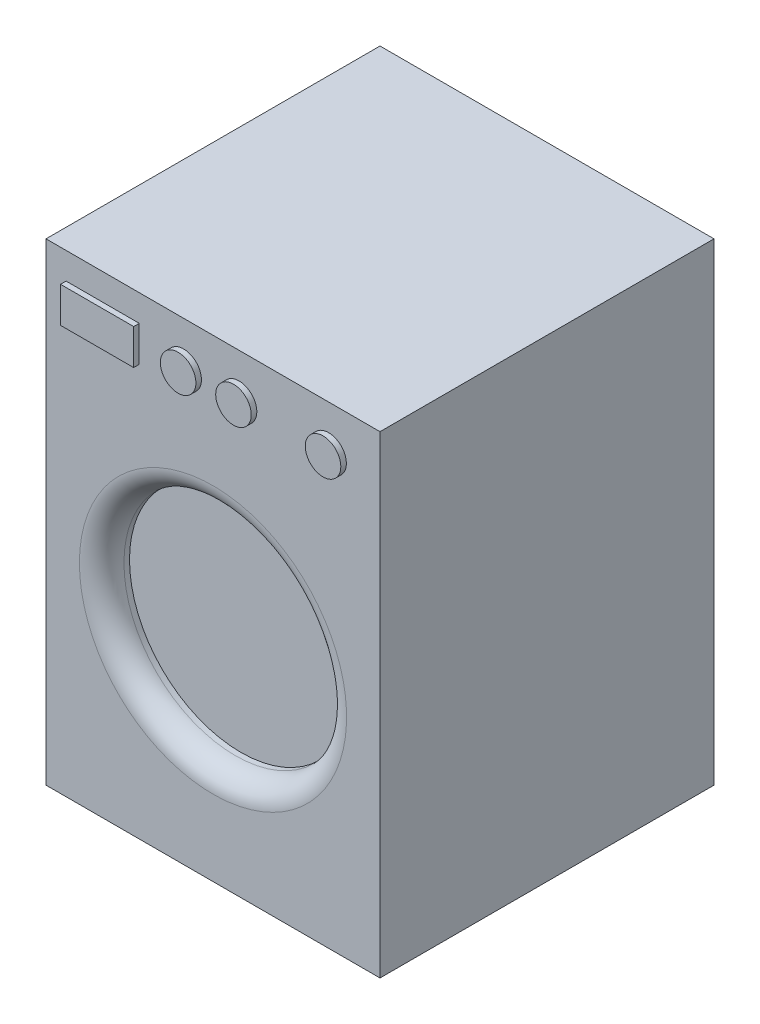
ISO-10303-21;
HEADER;
FILE_DESCRIPTION(('STEP AP214'),'2;1');
FILE_NAME('part.step','',(''),(''),'','','');
FILE_SCHEMA(('AUTOMOTIVE_DESIGN { 1 0 10303 214 1 1 1 1 }'));
ENDSEC;
DATA;
#1=APPLICATION_CONTEXT('core data for automotive mechanical design processes');
#2=APPLICATION_PROTOCOL_DEFINITION('international standard','automotive_design',2000,#1);
#3=PRODUCT_CONTEXT('',#1,'mechanical');
#4=PRODUCT('Part','Part','',(#3));
#5=PRODUCT_RELATED_PRODUCT_CATEGORY('part','',(#4));
#6=PRODUCT_DEFINITION_FORMATION('','',#4);
#7=PRODUCT_DEFINITION_CONTEXT('part definition',#1,'design');
#8=PRODUCT_DEFINITION('design','',#6,#7);
#9=PRODUCT_DEFINITION_SHAPE('','',#8);
#10=(LENGTH_UNIT() NAMED_UNIT(*) SI_UNIT(.MILLI.,.METRE.));
#11=(NAMED_UNIT(*) PLANE_ANGLE_UNIT() SI_UNIT($,.RADIAN.));
#12=(NAMED_UNIT(*) SI_UNIT($,.STERADIAN.) SOLID_ANGLE_UNIT());
#13=UNCERTAINTY_MEASURE_WITH_UNIT(LENGTH_MEASURE(1.E-05),#10,'distance_accuracy_value','');
#14=(GEOMETRIC_REPRESENTATION_CONTEXT(3) GLOBAL_UNCERTAINTY_ASSIGNED_CONTEXT((#13)) GLOBAL_UNIT_ASSIGNED_CONTEXT((#10,
#11,#12)) REPRESENTATION_CONTEXT('',''));
#15=CARTESIAN_POINT('',(0.,0.,0.));
#16=DIRECTION('',(0.,0.,1.));
#17=DIRECTION('',(1.,0.,0.));
#18=AXIS2_PLACEMENT_3D('',#15,#16,#17);
#19=CARTESIAN_POINT('',(300.,850.,300.));
#20=DIRECTION('',(0.,0.,-1.));
#21=DIRECTION('',(-1.,0.,0.));
#22=AXIS2_PLACEMENT_3D('',#19,#20,#21);
#23=PLANE('',#22);
#24=CARTESIAN_POINT('',(207.647023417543,770.356504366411,300.));
#25=DIRECTION('',(0.,0.,-1.));
#26=DIRECTION('',(-1.,0.,0.));
#27=AXIS2_PLACEMENT_3D('',#24,#25,#26);
#28=CIRCLE('',#27,31.9295040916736);
#29=CARTESIAN_POINT('',(175.71751932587,770.356504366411,300.));
#30=VERTEX_POINT('',#29);
#31=EDGE_CURVE('E11',#30,#30,#28,.F.);
#32=ORIENTED_EDGE('',*,*,#31,.F.);
#33=EDGE_LOOP('',(#32));
#34=FACE_BOUND('',#33,.T.);
#35=CARTESIAN_POINT('',(46.7714451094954,770.356504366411,300.));
#36=DIRECTION('',(0.,0.,-1.));
#37=DIRECTION('',(-1.,0.,0.));
#38=AXIS2_PLACEMENT_3D('',#35,#36,#37);
#39=CIRCLE('',#38,31.9295040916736);
#40=CARTESIAN_POINT('',(14.8419410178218,770.356504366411,300.));
#41=VERTEX_POINT('',#40);
#42=EDGE_CURVE('E42',#41,#41,#39,.F.);
#43=ORIENTED_EDGE('',*,*,#42,.F.);
#44=EDGE_LOOP('',(#43));
#45=FACE_BOUND('',#44,.T.);
#46=CARTESIAN_POINT('',(-52.7012407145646,770.356504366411,300.));
#47=DIRECTION('',(0.,0.,-1.));
#48=DIRECTION('',(-1.,0.,0.));
#49=AXIS2_PLACEMENT_3D('',#46,#47,#48);
#50=CIRCLE('',#49,31.9295040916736);
#51=CARTESIAN_POINT('',(-84.6307448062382,770.356504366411,300.));
#52=VERTEX_POINT('',#51);
#53=EDGE_CURVE('E164',#52,#52,#50,.F.);
#54=ORIENTED_EDGE('',*,*,#53,.F.);
#55=EDGE_LOOP('',(#54));
#56=FACE_BOUND('',#55,.T.);
#57=DIRECTION('',(1.,0.,0.));
#58=VECTOR('',#57,1.);
#59=CARTESIAN_POINT('',(300.,0.,300.));
#60=LINE('',#59,#58);
#61=CARTESIAN_POINT('',(-300.,0.,300.));
#62=VERTEX_POINT('',#61);
#63=CARTESIAN_POINT('',(300.,0.,300.));
#64=VERTEX_POINT('',#63);
#65=EDGE_CURVE('E142',#62,#64,#60,.T.);
#66=ORIENTED_EDGE('',*,*,#65,.T.);
#67=DIRECTION('',(0.,-1.,0.));
#68=VECTOR('',#67,1.);
#69=CARTESIAN_POINT('',(300.,850.,300.));
#70=LINE('',#69,#68);
#71=CARTESIAN_POINT('',(300.,850.,300.));
#72=VERTEX_POINT('',#71);
#73=EDGE_CURVE('E152',#72,#64,#70,.T.);
#74=ORIENTED_EDGE('',*,*,#73,.F.);
#75=DIRECTION('',(1.,0.,0.));
#76=VECTOR('',#75,1.);
#77=CARTESIAN_POINT('',(300.,850.,300.));
#78=LINE('',#77,#76);
#79=CARTESIAN_POINT('',(-300.,850.,300.));
#80=VERTEX_POINT('',#79);
#81=EDGE_CURVE('E132',#80,#72,#78,.T.);
#82=ORIENTED_EDGE('',*,*,#81,.F.);
#83=DIRECTION('',(0.,-1.,0.));
#84=VECTOR('',#83,1.);
#85=CARTESIAN_POINT('',(-300.,850.,300.));
#86=LINE('',#85,#84);
#87=EDGE_CURVE('E155',#80,#62,#86,.T.);
#88=ORIENTED_EDGE('',*,*,#87,.T.);
#89=EDGE_LOOP('',(#66,#74,#82,#88));
#90=FACE_BOUND('',#89,.T.);
#91=CARTESIAN_POINT('',(0.,375.977513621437,300.));
#92=DIRECTION('',(0.,0.,-1.));
#93=DIRECTION('',(-1.,0.,0.));
#94=AXIS2_PLACEMENT_3D('',#91,#92,#93);
#95=CIRCLE('',#94,240.);
#96=CARTESIAN_POINT('',(-240.,375.977513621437,300.));
#97=VERTEX_POINT('',#96);
#98=EDGE_CURVE('E161',#97,#97,#95,.T.);
#99=ORIENTED_EDGE('',*,*,#98,.T.);
#100=EDGE_LOOP('',(#99));
#101=FACE_BOUND('',#100,.T.);
#102=DIRECTION('',(0.,-1.,0.));
#103=VECTOR('',#102,1.);
#104=CARTESIAN_POINT('',(-263.927190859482,802.286008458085,300.));
#105=LINE('',#104,#103);
#106=CARTESIAN_POINT('',(-263.927190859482,802.286008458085,300.));
#107=VERTEX_POINT('',#106);
#108=CARTESIAN_POINT('',(-263.927190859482,738.427000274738,300.));
#109=VERTEX_POINT('',#108);
#110=EDGE_CURVE('E119',#107,#109,#105,.T.);
#111=ORIENTED_EDGE('',*,*,#110,.F.);
#112=DIRECTION('',(-1.,0.,0.));
#113=VECTOR('',#112,1.);
#114=CARTESIAN_POINT('',(-263.927190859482,802.286008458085,300.));
#115=LINE('',#114,#113);
#116=CARTESIAN_POINT('',(-132.525000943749,802.286008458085,300.));
#117=VERTEX_POINT('',#116);
#118=EDGE_CURVE('E116',#117,#107,#115,.T.);
#119=ORIENTED_EDGE('',*,*,#118,.F.);
#120=DIRECTION('',(0.,1.,0.));
#121=VECTOR('',#120,1.);
#122=CARTESIAN_POINT('',(-132.525000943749,802.286008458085,300.));
#123=LINE('',#122,#121);
#124=CARTESIAN_POINT('',(-132.525000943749,738.427000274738,300.));
#125=VERTEX_POINT('',#124);
#126=EDGE_CURVE('E54',#125,#117,#123,.T.);
#127=ORIENTED_EDGE('',*,*,#126,.F.);
#128=DIRECTION('',(1.,0.,0.));
#129=VECTOR('',#128,1.);
#130=CARTESIAN_POINT('',(-263.927190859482,738.427000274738,300.));
#131=LINE('',#130,#129);
#132=EDGE_CURVE('E49',#109,#125,#131,.T.);
#133=ORIENTED_EDGE('',*,*,#132,.F.);
#134=EDGE_LOOP('',(#111,#119,#127,#133));
#135=FACE_BOUND('',#134,.T.);
#136=ADVANCED_FACE('F34',(#34,#45,#56,#90,#101,#135),#23,.F.);
#137=CARTESIAN_POINT('',(-300.,850.,300.));
#138=DIRECTION('',(1.,0.,0.));
#139=DIRECTION('',(0.,0.,-1.));
#140=AXIS2_PLACEMENT_3D('',#137,#138,#139);
#141=PLANE('',#140);
#142=DIRECTION('',(0.,0.,1.));
#143=VECTOR('',#142,1.);
#144=CARTESIAN_POINT('',(-300.,0.,300.));
#145=LINE('',#144,#143);
#146=CARTESIAN_POINT('',(-300.,0.,-300.));
#147=VERTEX_POINT('',#146);
#148=EDGE_CURVE('E123',#147,#62,#145,.T.);
#149=ORIENTED_EDGE('',*,*,#148,.T.);
#150=ORIENTED_EDGE('',*,*,#87,.F.);
#151=DIRECTION('',(0.,0.,1.));
#152=VECTOR('',#151,1.);
#153=CARTESIAN_POINT('',(-300.,850.,300.));
#154=LINE('',#153,#152);
#155=CARTESIAN_POINT('',(-300.,850.,-300.));
#156=VERTEX_POINT('',#155);
#157=EDGE_CURVE('E129',#156,#80,#154,.T.);
#158=ORIENTED_EDGE('',*,*,#157,.F.);
#159=DIRECTION('',(0.,-1.,0.));
#160=VECTOR('',#159,1.);
#161=CARTESIAN_POINT('',(-300.,850.,-300.));
#162=LINE('',#161,#160);
#163=EDGE_CURVE('E139',#156,#147,#162,.T.);
#164=ORIENTED_EDGE('',*,*,#163,.T.);
#165=EDGE_LOOP('',(#149,#150,#158,#164));
#166=FACE_BOUND('',#165,.T.);
#167=ADVANCED_FACE('F173',(#166),#141,.F.);
#168=CARTESIAN_POINT('',(300.,850.,300.));
#169=DIRECTION('',(-1.,0.,0.));
#170=DIRECTION('',(0.,0.,1.));
#171=AXIS2_PLACEMENT_3D('',#168,#169,#170);
#172=PLANE('',#171);
#173=DIRECTION('',(0.,0.,-1.));
#174=VECTOR('',#173,1.);
#175=CARTESIAN_POINT('',(300.,0.,300.));
#176=LINE('',#175,#174);
#177=CARTESIAN_POINT('',(300.,0.,-300.));
#178=VERTEX_POINT('',#177);
#179=EDGE_CURVE('E144',#64,#178,#176,.T.);
#180=ORIENTED_EDGE('',*,*,#179,.T.);
#181=DIRECTION('',(0.,-1.,0.));
#182=VECTOR('',#181,1.);
#183=CARTESIAN_POINT('',(300.,850.,-300.));
#184=LINE('',#183,#182);
#185=CARTESIAN_POINT('',(300.,850.,-300.));
#186=VERTEX_POINT('',#185);
#187=EDGE_CURVE('E149',#186,#178,#184,.T.);
#188=ORIENTED_EDGE('',*,*,#187,.F.);
#189=DIRECTION('',(0.,0.,-1.));
#190=VECTOR('',#189,1.);
#191=CARTESIAN_POINT('',(300.,850.,300.));
#192=LINE('',#191,#190);
#193=EDGE_CURVE('E135',#72,#186,#192,.T.);
#194=ORIENTED_EDGE('',*,*,#193,.F.);
#195=ORIENTED_EDGE('',*,*,#73,.T.);
#196=EDGE_LOOP('',(#180,#188,#194,#195));
#197=FACE_BOUND('',#196,.T.);
#198=ADVANCED_FACE('F263',(#197),#172,.F.);
#199=CARTESIAN_POINT('',(300.,850.,-300.));
#200=DIRECTION('',(0.,0.,1.));
#201=DIRECTION('',(1.,0.,0.));
#202=AXIS2_PLACEMENT_3D('',#199,#200,#201);
#203=PLANE('',#202);
#204=DIRECTION('',(-1.,0.,0.));
#205=VECTOR('',#204,1.);
#206=CARTESIAN_POINT('',(300.,0.,-300.));
#207=LINE('',#206,#205);
#208=EDGE_CURVE('E133',#178,#147,#207,.T.);
#209=ORIENTED_EDGE('',*,*,#208,.T.);
#210=ORIENTED_EDGE('',*,*,#163,.F.);
#211=DIRECTION('',(-1.,0.,0.));
#212=VECTOR('',#211,1.);
#213=CARTESIAN_POINT('',(300.,850.,-300.));
#214=LINE('',#213,#212);
#215=EDGE_CURVE('E137',#186,#156,#214,.T.);
#216=ORIENTED_EDGE('',*,*,#215,.F.);
#217=ORIENTED_EDGE('',*,*,#187,.T.);
#218=EDGE_LOOP('',(#209,#210,#216,#217));
#219=FACE_BOUND('',#218,.T.);
#220=ADVANCED_FACE('F256',(#219),#203,.F.);
#221=CARTESIAN_POINT('',(0.,850.,0.));
#222=DIRECTION('',(0.,1.,0.));
#223=DIRECTION('',(0.,0.,1.));
#224=AXIS2_PLACEMENT_3D('',#221,#222,#223);
#225=PLANE('',#224);
#226=ORIENTED_EDGE('',*,*,#157,.T.);
#227=ORIENTED_EDGE('',*,*,#81,.T.);
#228=ORIENTED_EDGE('',*,*,#193,.T.);
#229=ORIENTED_EDGE('',*,*,#215,.T.);
#230=EDGE_LOOP('',(#226,#227,#228,#229));
#231=FACE_BOUND('',#230,.T.);
#232=ADVANCED_FACE('F253',(#231),#225,.T.);
#233=CARTESIAN_POINT('',(0.,0.,0.));
#234=DIRECTION('',(0.,1.,0.));
#235=DIRECTION('',(0.,0.,1.));
#236=AXIS2_PLACEMENT_3D('',#233,#234,#235);
#237=PLANE('',#236);
#238=ORIENTED_EDGE('',*,*,#148,.F.);
#239=ORIENTED_EDGE('',*,*,#208,.F.);
#240=ORIENTED_EDGE('',*,*,#179,.F.);
#241=ORIENTED_EDGE('',*,*,#65,.F.);
#242=EDGE_LOOP('',(#238,#239,#240,#241));
#243=FACE_BOUND('',#242,.T.);
#244=ADVANCED_FACE('F251',(#243),#237,.F.);
#245=CARTESIAN_POINT('',(0.,375.977513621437,250.));
#246=DIRECTION('',(0.,0.,1.));
#247=DIRECTION('',(1.,0.,0.));
#248=AXIS2_PLACEMENT_3D('',#245,#246,#247);
#249=CYLINDRICAL_SURFACE('',#248,200.);
#250=CARTESIAN_POINT('',(0.,375.977513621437,260.));
#251=DIRECTION('',(0.,0.,-1.));
#252=DIRECTION('',(-1.,0.,0.));
#253=AXIS2_PLACEMENT_3D('',#250,#251,#252);
#254=CIRCLE('',#253,200.);
#255=CARTESIAN_POINT('',(-200.,375.977513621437,260.));
#256=VERTEX_POINT('',#255);
#257=EDGE_CURVE('E158',#256,#256,#254,.F.);
#258=ORIENTED_EDGE('',*,*,#257,.T.);
#259=EDGE_LOOP('',(#258));
#260=FACE_BOUND('',#259,.T.);
#261=CARTESIAN_POINT('',(0.,375.977513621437,250.));
#262=DIRECTION('',(0.,0.,1.));
#263=DIRECTION('',(1.,0.,0.));
#264=AXIS2_PLACEMENT_3D('',#261,#262,#263);
#265=CIRCLE('',#264,200.);
#266=CARTESIAN_POINT('',(200.,375.977513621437,250.));
#267=VERTEX_POINT('',#266);
#268=EDGE_CURVE('E120',#267,#267,#265,.T.);
#269=ORIENTED_EDGE('',*,*,#268,.F.);
#270=EDGE_LOOP('',(#269));
#271=FACE_BOUND('',#270,.T.);
#272=ADVANCED_FACE('F247',(#260,#271),#249,.F.);
#273=CARTESIAN_POINT('',(0.,375.977513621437,250.));
#274=DIRECTION('',(0.,0.,1.));
#275=DIRECTION('',(1.,0.,0.));
#276=AXIS2_PLACEMENT_3D('',#273,#274,#275);
#277=PLANE('',#276);
#278=ORIENTED_EDGE('',*,*,#268,.T.);
#279=EDGE_LOOP('',(#278));
#280=FACE_BOUND('',#279,.T.);
#281=ADVANCED_FACE('F244',(#280),#277,.T.);
#282=CARTESIAN_POINT('',(0.,375.977513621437,260.));
#283=DIRECTION('',(0.,0.,-1.));
#284=DIRECTION('',(-1.,0.,0.));
#285=AXIS2_PLACEMENT_3D('',#282,#283,#284);
#286=TOROIDAL_SURFACE('',#285,240.,40.);
#287=ORIENTED_EDGE('',*,*,#98,.F.);
#288=EDGE_LOOP('',(#287));
#289=FACE_BOUND('',#288,.T.);
#290=ORIENTED_EDGE('',*,*,#257,.F.);
#291=EDGE_LOOP('',(#290));
#292=FACE_BOUND('',#291,.T.);
#293=ADVANCED_FACE('F36',(#289,#292),#286,.T.);
#294=CARTESIAN_POINT('',(-263.927190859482,802.286008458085,310.));
#295=DIRECTION('',(1.,0.,0.));
#296=DIRECTION('',(0.,0.,-1.));
#297=AXIS2_PLACEMENT_3D('',#294,#295,#296);
#298=PLANE('',#297);
#299=ORIENTED_EDGE('',*,*,#110,.T.);
#300=DIRECTION('',(0.,0.,-1.));
#301=VECTOR('',#300,1.);
#302=CARTESIAN_POINT('',(-263.927190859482,738.427000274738,310.));
#303=LINE('',#302,#301);
#304=CARTESIAN_POINT('',(-263.927190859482,738.427000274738,310.));
#305=VERTEX_POINT('',#304);
#306=EDGE_CURVE('E100',#305,#109,#303,.T.);
#307=ORIENTED_EDGE('',*,*,#306,.F.);
#308=DIRECTION('',(0.,-1.,0.));
#309=VECTOR('',#308,1.);
#310=CARTESIAN_POINT('',(-263.927190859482,802.286008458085,310.));
#311=LINE('',#310,#309);
#312=CARTESIAN_POINT('',(-263.927190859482,802.286008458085,310.));
#313=VERTEX_POINT('',#312);
#314=EDGE_CURVE('E107',#313,#305,#311,.T.);
#315=ORIENTED_EDGE('',*,*,#314,.F.);
#316=DIRECTION('',(0.,0.,-1.));
#317=VECTOR('',#316,1.);
#318=CARTESIAN_POINT('',(-263.927190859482,802.286008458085,310.));
#319=LINE('',#318,#317);
#320=EDGE_CURVE('E187',#313,#107,#319,.T.);
#321=ORIENTED_EDGE('',*,*,#320,.T.);
#322=EDGE_LOOP('',(#299,#307,#315,#321));
#323=FACE_BOUND('',#322,.T.);
#324=ADVANCED_FACE('F118',(#323),#298,.F.);
#325=CARTESIAN_POINT('',(-263.927190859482,738.427000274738,310.));
#326=DIRECTION('',(0.,1.,0.));
#327=DIRECTION('',(0.,0.,1.));
#328=AXIS2_PLACEMENT_3D('',#325,#326,#327);
#329=PLANE('',#328);
#330=ORIENTED_EDGE('',*,*,#132,.T.);
#331=DIRECTION('',(0.,0.,-1.));
#332=VECTOR('',#331,1.);
#333=CARTESIAN_POINT('',(-132.525000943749,738.427000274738,310.));
#334=LINE('',#333,#332);
#335=CARTESIAN_POINT('',(-132.525000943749,738.427000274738,310.));
#336=VERTEX_POINT('',#335);
#337=EDGE_CURVE('E103',#336,#125,#334,.T.);
#338=ORIENTED_EDGE('',*,*,#337,.F.);
#339=DIRECTION('',(1.,0.,0.));
#340=VECTOR('',#339,1.);
#341=CARTESIAN_POINT('',(-263.927190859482,738.427000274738,310.));
#342=LINE('',#341,#340);
#343=EDGE_CURVE('E96',#305,#336,#342,.T.);
#344=ORIENTED_EDGE('',*,*,#343,.F.);
#345=ORIENTED_EDGE('',*,*,#306,.T.);
#346=EDGE_LOOP('',(#330,#338,#344,#345));
#347=FACE_BOUND('',#346,.T.);
#348=ADVANCED_FACE('F98',(#347),#329,.F.);
#349=CARTESIAN_POINT('',(-132.525000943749,802.286008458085,310.));
#350=DIRECTION('',(-1.,0.,0.));
#351=DIRECTION('',(0.,0.,1.));
#352=AXIS2_PLACEMENT_3D('',#349,#350,#351);
#353=PLANE('',#352);
#354=ORIENTED_EDGE('',*,*,#126,.T.);
#355=DIRECTION('',(0.,0.,-1.));
#356=VECTOR('',#355,1.);
#357=CARTESIAN_POINT('',(-132.525000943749,802.286008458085,310.));
#358=LINE('',#357,#356);
#359=CARTESIAN_POINT('',(-132.525000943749,802.286008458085,310.));
#360=VERTEX_POINT('',#359);
#361=EDGE_CURVE('E125',#360,#117,#358,.T.);
#362=ORIENTED_EDGE('',*,*,#361,.F.);
#363=DIRECTION('',(0.,1.,0.));
#364=VECTOR('',#363,1.);
#365=CARTESIAN_POINT('',(-132.525000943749,802.286008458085,310.));
#366=LINE('',#365,#364);
#367=EDGE_CURVE('E106',#336,#360,#366,.T.);
#368=ORIENTED_EDGE('',*,*,#367,.F.);
#369=ORIENTED_EDGE('',*,*,#337,.T.);
#370=EDGE_LOOP('',(#354,#362,#368,#369));
#371=FACE_BOUND('',#370,.T.);
#372=ADVANCED_FACE('F236',(#371),#353,.F.);
#373=CARTESIAN_POINT('',(-263.927190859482,802.286008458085,310.));
#374=DIRECTION('',(0.,-1.,0.));
#375=DIRECTION('',(0.,0.,-1.));
#376=AXIS2_PLACEMENT_3D('',#373,#374,#375);
#377=PLANE('',#376);
#378=ORIENTED_EDGE('',*,*,#118,.T.);
#379=ORIENTED_EDGE('',*,*,#320,.F.);
#380=DIRECTION('',(-1.,0.,0.));
#381=VECTOR('',#380,1.);
#382=CARTESIAN_POINT('',(-263.927190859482,802.286008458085,310.));
#383=LINE('',#382,#381);
#384=EDGE_CURVE('E112',#360,#313,#383,.T.);
#385=ORIENTED_EDGE('',*,*,#384,.F.);
#386=ORIENTED_EDGE('',*,*,#361,.T.);
#387=EDGE_LOOP('',(#378,#379,#385,#386));
#388=FACE_BOUND('',#387,.T.);
#389=ADVANCED_FACE('F186',(#388),#377,.F.);
#390=CARTESIAN_POINT('',(0.,0.,310.));
#391=DIRECTION('',(0.,0.,1.));
#392=DIRECTION('',(1.,0.,0.));
#393=AXIS2_PLACEMENT_3D('',#390,#391,#392);
#394=PLANE('',#393);
#395=ORIENTED_EDGE('',*,*,#314,.T.);
#396=ORIENTED_EDGE('',*,*,#343,.T.);
#397=ORIENTED_EDGE('',*,*,#367,.T.);
#398=ORIENTED_EDGE('',*,*,#384,.T.);
#399=EDGE_LOOP('',(#395,#396,#397,#398));
#400=FACE_BOUND('',#399,.T.);
#401=ADVANCED_FACE('F110',(#400),#394,.T.);
#402=CARTESIAN_POINT('',(-52.7012407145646,770.356504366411,310.));
#403=DIRECTION('',(0.,0.,-1.));
#404=DIRECTION('',(-1.,0.,0.));
#405=AXIS2_PLACEMENT_3D('',#402,#403,#404);
#406=CYLINDRICAL_SURFACE('',#405,31.9295040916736);
#407=CARTESIAN_POINT('',(-52.7012407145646,770.356504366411,310.));
#408=DIRECTION('',(0.,0.,1.));
#409=DIRECTION('',(1.,0.,0.));
#410=AXIS2_PLACEMENT_3D('',#407,#408,#409);
#411=CIRCLE('',#410,31.9295040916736);
#412=CARTESIAN_POINT('',(-20.771736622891,770.356504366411,310.));
#413=VERTEX_POINT('',#412);
#414=EDGE_CURVE('E182',#413,#413,#411,.T.);
#415=ORIENTED_EDGE('',*,*,#414,.F.);
#416=EDGE_LOOP('',(#415));
#417=FACE_BOUND('',#416,.T.);
#418=ORIENTED_EDGE('',*,*,#53,.T.);
#419=EDGE_LOOP('',(#418));
#420=FACE_BOUND('',#419,.T.);
#421=ADVANCED_FACE('F227',(#417,#420),#406,.T.);
#422=CARTESIAN_POINT('',(-52.7012407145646,770.356504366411,310.));
#423=DIRECTION('',(0.,0.,1.));
#424=DIRECTION('',(1.,0.,0.));
#425=AXIS2_PLACEMENT_3D('',#422,#423,#424);
#426=PLANE('',#425);
#427=ORIENTED_EDGE('',*,*,#414,.T.);
#428=EDGE_LOOP('',(#427));
#429=FACE_BOUND('',#428,.T.);
#430=ADVANCED_FACE('F223',(#429),#426,.T.);
#431=CARTESIAN_POINT('',(46.7714451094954,770.356504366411,310.));
#432=DIRECTION('',(0.,0.,-1.));
#433=DIRECTION('',(-1.,0.,0.));
#434=AXIS2_PLACEMENT_3D('',#431,#432,#433);
#435=CYLINDRICAL_SURFACE('',#434,31.9295040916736);
#436=CARTESIAN_POINT('',(46.7714451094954,770.356504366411,310.));
#437=DIRECTION('',(0.,0.,1.));
#438=DIRECTION('',(1.,0.,0.));
#439=AXIS2_PLACEMENT_3D('',#436,#437,#438);
#440=CIRCLE('',#439,31.9295040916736);
#441=CARTESIAN_POINT('',(78.700949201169,770.356504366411,310.));
#442=VERTEX_POINT('',#441);
#443=EDGE_CURVE('E198',#442,#442,#440,.T.);
#444=ORIENTED_EDGE('',*,*,#443,.F.);
#445=EDGE_LOOP('',(#444));
#446=FACE_BOUND('',#445,.T.);
#447=ORIENTED_EDGE('',*,*,#42,.T.);
#448=EDGE_LOOP('',(#447));
#449=FACE_BOUND('',#448,.T.);
#450=ADVANCED_FACE('F169',(#446,#449),#435,.T.);
#451=CARTESIAN_POINT('',(46.7714451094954,770.356504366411,310.));
#452=DIRECTION('',(0.,0.,1.));
#453=DIRECTION('',(1.,0.,0.));
#454=AXIS2_PLACEMENT_3D('',#451,#452,#453);
#455=PLANE('',#454);
#456=ORIENTED_EDGE('',*,*,#443,.T.);
#457=EDGE_LOOP('',(#456));
#458=FACE_BOUND('',#457,.T.);
#459=ADVANCED_FACE('F210',(#458),#455,.T.);
#460=CARTESIAN_POINT('',(207.647023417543,770.356504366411,310.));
#461=DIRECTION('',(0.,0.,-1.));
#462=DIRECTION('',(-1.,0.,0.));
#463=AXIS2_PLACEMENT_3D('',#460,#461,#462);
#464=CYLINDRICAL_SURFACE('',#463,31.9295040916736);
#465=CARTESIAN_POINT('',(207.647023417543,770.356504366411,310.));
#466=DIRECTION('',(0.,0.,1.));
#467=DIRECTION('',(1.,0.,0.));
#468=AXIS2_PLACEMENT_3D('',#465,#466,#467);
#469=CIRCLE('',#468,31.9295040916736);
#470=CARTESIAN_POINT('',(239.576527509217,770.356504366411,310.));
#471=VERTEX_POINT('',#470);
#472=EDGE_CURVE('E201',#471,#471,#469,.T.);
#473=ORIENTED_EDGE('',*,*,#472,.F.);
#474=EDGE_LOOP('',(#473));
#475=FACE_BOUND('',#474,.T.);
#476=ORIENTED_EDGE('',*,*,#31,.T.);
#477=EDGE_LOOP('',(#476));
#478=FACE_BOUND('',#477,.T.);
#479=ADVANCED_FACE('F207',(#475,#478),#464,.T.);
#480=CARTESIAN_POINT('',(207.647023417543,770.356504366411,310.));
#481=DIRECTION('',(0.,0.,1.));
#482=DIRECTION('',(1.,0.,0.));
#483=AXIS2_PLACEMENT_3D('',#480,#481,#482);
#484=PLANE('',#483);
#485=ORIENTED_EDGE('',*,*,#472,.T.);
#486=EDGE_LOOP('',(#485));
#487=FACE_BOUND('',#486,.T.);
#488=ADVANCED_FACE('F205',(#487),#484,.T.);
#489=CLOSED_SHELL('',(#136,#167,#198,#220,#232,#244,#272,#281,#293,#324,#348,#372,#389,#401,
#421,#430,#450,#459,#479,#488));
#490=MANIFOLD_SOLID_BREP('B2',#489);
#491=ADVANCED_BREP_SHAPE_REPRESENTATION('',(#18,#490),#14);
#492=SHAPE_DEFINITION_REPRESENTATION(#9,#491);
ENDSEC;
END-ISO-10303-21;
